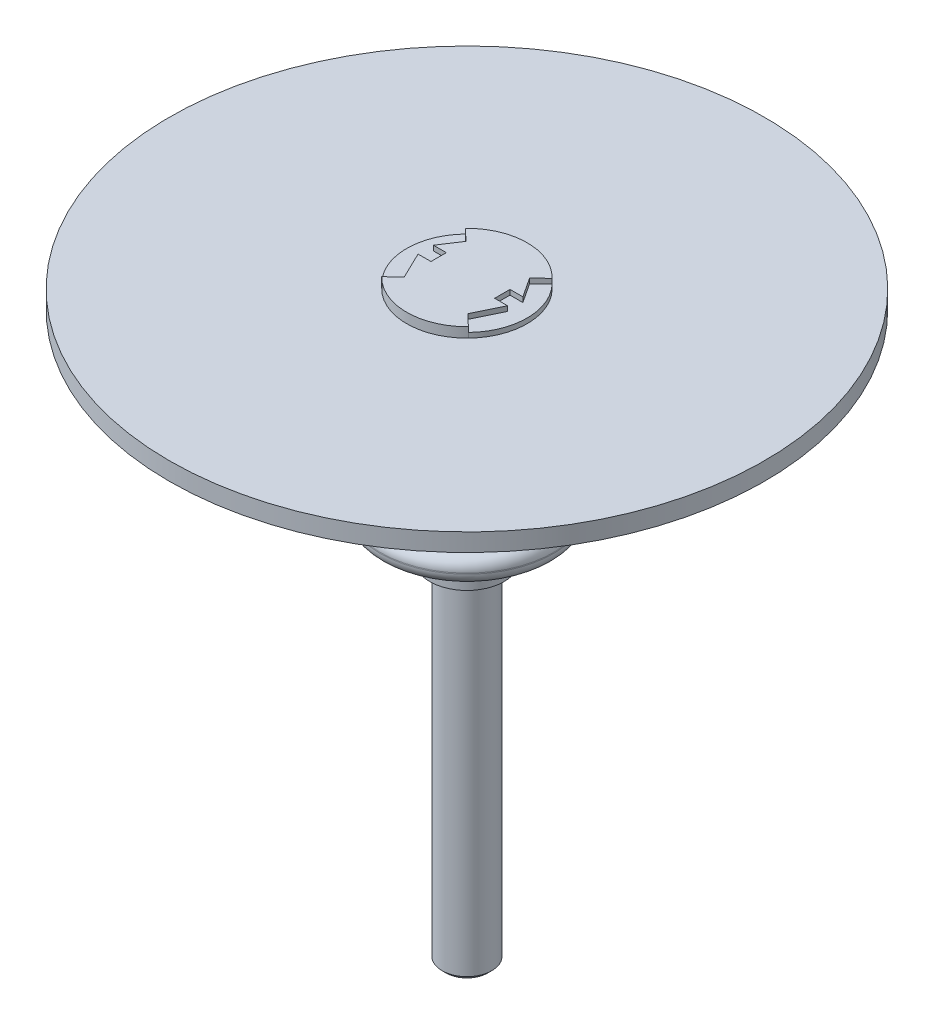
from build123d import *

# Parameters (mm, degrees)
SKETCH1_R             = 1.5875
BOSS_EXTRUDE1_DEPTH   = 22.225
CHAMFER1_SIZE         = 0.254
SKETCH2_R             = 2.38125
BOSS_EXTRUDE2_DEPTH   = 2.38125
SKETCH3_R             = 5.55625
BOSS_EXTRUDE3_DEPTH   = 1.5875
SKETCH4_R             = 4.365625
BOSS_EXTRUDE4_DEPTH   = 9.128125
FILLET1_R             = 0.762
FILLET2_R             = 0.254
CHAMFER2_SIZE         = 0.508
SKETCH5_R             = 3.857625
BOSS_EXTRUDE5_DEPTH   = 0.79375
SKETCH6_R             = 19.05
BOSS_EXTRUDE6_DEPTH   = 1.143
BOSS_EXTRUDE7_DEPTH   = 0.3175
BOSS_EXTRUDE7_2_DEPTH = 0.3175
BOSS_EXTRUDE8_DEPTH   = 0.635
SKETCH9_R             = 4.79425
SKETCH9_R_2           = 2.38125
CUT_EXTRUDE1_DEPTH    = 1.27


with BuildPart() as part:
    # Sketch1 → Boss-Extrude1 (new body)
    with BuildSketch(Plane(origin=(0, 0, 0), x_dir=(1, 0, 0), z_dir=(0, 1, 0))):
        with Locations(Location((0, 0, 0), (0, 0, 270))):
            Circle(SKETCH1_R)
    extrude(amount=BOSS_EXTRUDE1_DEPTH)

    # Chamfer1
    chamfer1_edges = [part.edges().sort_by_distance(p)[0] for p in [
        (0, 0, -1.5875),
    ]]
    chamfer(chamfer1_edges, length=CHAMFER1_SIZE)


with BuildPart() as body_2:
    # Sketch2 → Boss-Extrude2 (new body)
    with BuildSketch(Plane(origin=(0, 22.225, 0), x_dir=(1, 0, 0), z_dir=(0, 1, 0))):
        with Locations(Location((0, 0, 0), (0, 0, 90))):
            Circle(SKETCH2_R)
    extrude(amount=BOSS_EXTRUDE2_DEPTH)


with BuildPart() as body_3:
    # Sketch3 → Boss-Extrude3 (new body)
    with BuildSketch(Plane(origin=(0, 24.60625, 0), x_dir=(1, 0, 0), z_dir=(0, 1, 0))):
        with Locations(Location((0, 0, 0), (0, 0, 270))):
            Circle(SKETCH3_R)
    extrude(amount=BOSS_EXTRUDE3_DEPTH)

    # Sketch4 → Boss-Extrude4 (add)
    with BuildSketch(Plane(origin=(0, 26.19375, 0), x_dir=(1, 0, 0), z_dir=(0, 1, 0))):
        with Locations(Location((0, 0, 0), (0, 0, 270))):
            Circle(SKETCH4_R)
    extrude(amount=BOSS_EXTRUDE4_DEPTH)

    # Fillet1
    fillet1_edges = [body_3.edges().sort_by_distance(p)[0] for p in [
        (0, 24.60625, -5.55625),
        (0, 26.19375, -5.55625),
    ]]
    fillet(fillet1_edges, radius=FILLET1_R)

    # Fillet2
    fillet2_edges = [body_3.edges().sort_by_distance(p)[0] for p in [
        (0, 26.19375, -4.365625),
    ]]
    fillet(fillet2_edges, radius=FILLET2_R)

    # Chamfer2
    chamfer2_edges = [body_3.edges().sort_by_distance(p)[0] for p in [
        (0, 35.321875, -4.365625),
    ]]
    chamfer(chamfer2_edges, length=CHAMFER2_SIZE)

    # Sketch5 → Boss-Extrude5 (add)
    with BuildSketch(Plane(origin=(0, 35.321875, 0), x_dir=(1, 0, 0), z_dir=(0, 1, 0))):
        with Locations(Location((0, 0, 0), (0, 0, 270))):
            Circle(SKETCH5_R)
    extrude(amount=BOSS_EXTRUDE5_DEPTH)

    # Sketch9 → Cut-Extrude1 (cut)
    with BuildSketch(Plane.XZ.offset(-24.60625)):
        with Locations(Location((0, 0, 0), (0, 0, 270))):
            Circle(SKETCH9_R)
        with Locations(Location((0, 0, 0), (0, 0, 270))):
            Circle(SKETCH9_R_2, mode=Mode.SUBTRACT)
    extrude(amount=-CUT_EXTRUDE1_DEPTH, mode=Mode.SUBTRACT)


with BuildPart() as body_4:
    # Sketch6 → Boss-Extrude6 (new body)
    with BuildSketch(Plane(origin=(0, 36.115625, 0), x_dir=(1, 0, 0), z_dir=(0, 1, 0))):
        with Locations(Location((0, 0, 0), (0, 0, 270))):
            Circle(SKETCH6_R)
    extrude(amount=BOSS_EXTRUDE6_DEPTH)


with BuildPart() as body_5:
    # Sketch7 → Boss-Extrude7 (new body)
    with BuildSketch(Plane(origin=(0, 37.258625, 0), x_dir=(1, 0, 0), z_dir=(0, 1, 0))):
        with BuildLine():
            Line((-2.038100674, 1.972177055), (-2.772218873, 2.68254975))
            ThreePointArc((-2.772218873, 2.68254975), (-3.857625, 0), (-2.772218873, -2.68254975))
            Line((-2.772218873, -2.68254975), (-2.038100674, -1.972177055))
            Line((-2.038100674, -1.972177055), (-2.862733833, -0.265265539))
            Line((-2.862733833, -0.265265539), (-2.038100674, -0.265265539))
            Line((-2.038100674, -0.265265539), (-2.038100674, 0.71881341))
            Line((-2.038100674, 0.71881341), (-2.862733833, 0.71881341))
            Line((-2.862733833, 0.71881341), (-2.038100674, 1.972177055))
        make_face()
    extrude(amount=BOSS_EXTRUDE7_DEPTH)


with BuildPart() as body_6:
    # Sketch7 → Boss-Extrude7 2 (new body)
    with BuildSketch(Plane(origin=(0, 37.258625, 0), x_dir=(1, 0, 0), z_dir=(0, 1, 0))):
        with BuildLine():
            ThreePointArc((3.857625, 0), (3.575992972, 1.446908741), (2.772218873, 2.68254975))
            Line((2.772218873, 2.68254975), (2.038100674, 1.972177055))
            Line((2.038100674, 1.972177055), (2.862733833, 0.71881341))
            Line((2.862733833, 0.71881341), (2.038100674, 0.71881341))
            Line((2.038100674, 0.71881341), (2.038100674, -0.265265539))
            Line((2.038100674, -0.265265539), (2.862733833, -0.265265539))
            Line((2.862733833, -0.265265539), (2.038100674, -1.972177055))
            Line((2.038100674, -1.972177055), (2.772218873, -2.68254975))
            ThreePointArc((2.772218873, -2.68254975), (3.575992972, -1.446908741), (3.857625, 0))
        make_face()
    extrude(amount=BOSS_EXTRUDE7_2_DEPTH)


with BuildPart() as body_7:
    # Sketch8 → Boss-Extrude8 (new body)
    with BuildSketch(Plane(origin=(0, 37.258625, 0), x_dir=(1, 0, 0), z_dir=(0, 1, 0))):
        with BuildLine():
            Line((-2.772218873, -2.68254975), (-2.038100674, -1.972177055))
            Line((-2.038100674, -1.972177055), (-2.862733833, -0.265265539))
            Line((-2.862733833, -0.265265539), (-2.038100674, -0.265265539))
            Line((-2.038100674, -0.265265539), (-2.038100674, 0.71881341))
            Line((-2.038100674, 0.71881341), (-2.862733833, 0.71881341))
            Line((-2.862733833, 0.71881341), (-2.038100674, 1.972177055))
            Line((-2.038100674, 1.972177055), (-2.772218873, 2.68254975))
            ThreePointArc((-2.772218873, 2.68254975), (0, 3.857625), (2.772218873, 2.68254975))
            Line((2.772218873, 2.68254975), (2.038100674, 1.972177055))
            Line((2.038100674, 1.972177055), (2.862733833, 0.71881341))
            Line((2.862733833, 0.71881341), (2.038100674, 0.71881341))
            Line((2.038100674, 0.71881341), (2.038100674, -0.265265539))
            Line((2.038100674, -0.265265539), (2.862733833, -0.265265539))
            Line((2.862733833, -0.265265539), (2.038100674, -1.972177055))
            Line((2.038100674, -1.972177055), (2.772218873, -2.68254975))
            ThreePointArc((2.772218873, -2.68254975), (0, -3.857625), (-2.772218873, -2.68254975))
        make_face()
    extrude(amount=BOSS_EXTRUDE8_DEPTH)


solid = Compound([part.part, body_2.part, body_3.part, body_4.part, body_5.part, body_6.part, body_7.part])
